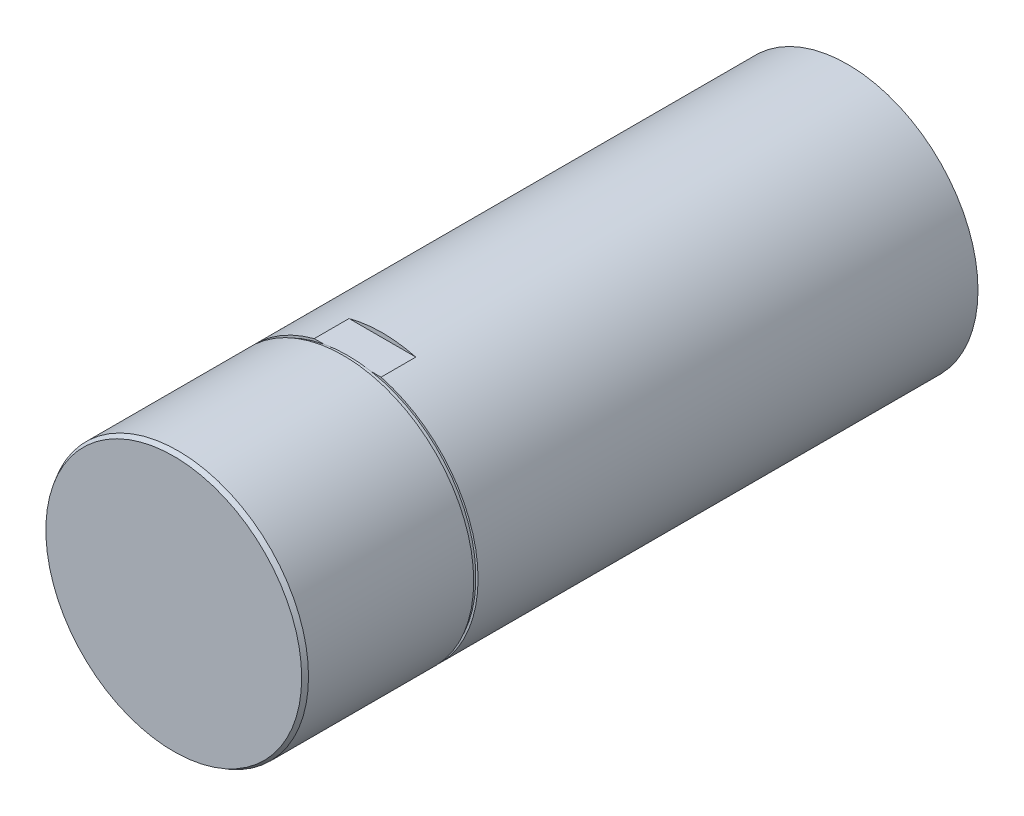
from build123d import *

# Parameters (mm, degrees)
SKETCH1_R        = 30
STROKE_DEPTH     = 100
EXTRUDE_START    = 15
SKETCH2_R        = 30
EXTRUDE_L2_DEPTH = 15
EXTRUDE_START_2  = 40
SKETCH3_R        = 30
EXTRUDE_L3_DEPTH = 40
CHAMFER2_SIZE    = 1
CHAMFER2_SIZE2   = 0.577350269
U_C_START        = 1
SKETCH5_R        = 30
SKETCH5_R_2      = 29.5
U_C_DEPTH        = 1
SKETCH6_W        = 8
SKETCH6_H        = 1.5
A_F_DEPTH        = 10.5


with BuildPart() as part:
    # Sketch1 → STROKE (new body)
    with BuildSketch(Plane.XY):
        Circle(SKETCH1_R)
    extrude(amount=-STROKE_DEPTH)

    # Sketch2 → Extrude L2 (add)
    with BuildSketch(Plane.XY.offset(EXTRUDE_START)):
        Circle(SKETCH2_R)
    extrude(amount=-EXTRUDE_L2_DEPTH)

    # Sketch3 → Extrude L3 (add)
    with BuildSketch(Plane.XY.offset(15).offset(EXTRUDE_START_2)):
        Circle(SKETCH3_R)
    extrude(amount=-EXTRUDE_L3_DEPTH)

    # Chamfer2
    chamfer2_edges = [part.edges().sort_by_distance(p)[0] for p in [
        (-30, 0, 55),
    ]]
    chamfer2_side = [part.faces().sort_by_distance(p)[0] for p in [
        (-30, 0, -22.5),
    ]]
    chamfer(chamfer2_edges, length=CHAMFER2_SIZE, length2=CHAMFER2_SIZE2, reference=chamfer2_side[0])

    # Sketch5 → U_C (cut)
    with BuildSketch(Plane.XY.offset(15).offset(U_C_START)):
        Circle(SKETCH5_R)
        Circle(SKETCH5_R_2, mode=Mode.SUBTRACT)
    extrude(amount=-U_C_DEPTH, mode=Mode.SUBTRACT)

    # Sketch6 → A_F (cut, symmetric)
    with BuildSketch(Plane(origin=(0, 0, 0), x_dir=(0, 0, -1), z_dir=(1, 0, 0))):
        with Locations((-11, 29.75)):
            Rectangle(SKETCH6_W, SKETCH6_H)
        with Locations((-11, -29.75)):
            Rectangle(SKETCH6_W, SKETCH6_H)
    extrude(amount=A_F_DEPTH, both=True, mode=Mode.SUBTRACT)


solid = part.part
